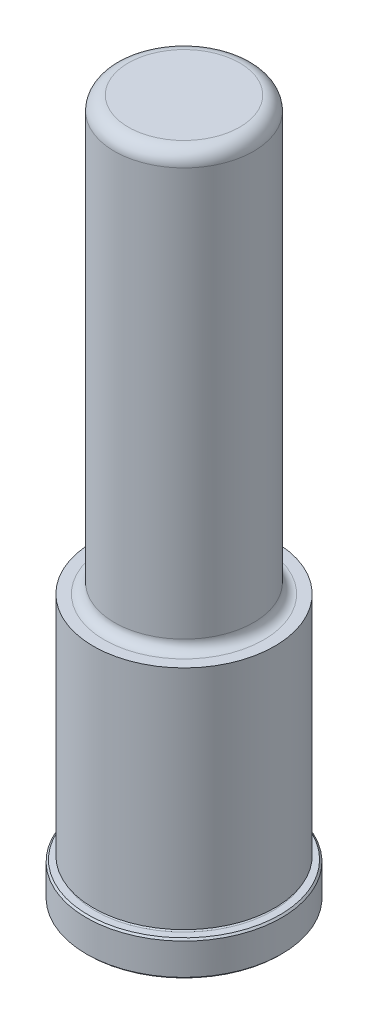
ISO-10303-21;
HEADER;
FILE_DESCRIPTION(('STEP AP214'),'2;1');
FILE_NAME('part.step','',(''),(''),'','','');
FILE_SCHEMA(('AUTOMOTIVE_DESIGN { 1 0 10303 214 1 1 1 1 }'));
ENDSEC;
DATA;
#1=APPLICATION_CONTEXT('core data for automotive mechanical design processes');
#2=APPLICATION_PROTOCOL_DEFINITION('international standard','automotive_design',2000,#1);
#3=PRODUCT_CONTEXT('',#1,'mechanical');
#4=PRODUCT('Part','Part','',(#3));
#5=PRODUCT_RELATED_PRODUCT_CATEGORY('part','',(#4));
#6=PRODUCT_DEFINITION_FORMATION('','',#4);
#7=PRODUCT_DEFINITION_CONTEXT('part definition',#1,'design');
#8=PRODUCT_DEFINITION('design','',#6,#7);
#9=PRODUCT_DEFINITION_SHAPE('','',#8);
#10=(LENGTH_UNIT() NAMED_UNIT(*) SI_UNIT(.MILLI.,.METRE.));
#11=(NAMED_UNIT(*) PLANE_ANGLE_UNIT() SI_UNIT($,.RADIAN.));
#12=(NAMED_UNIT(*) SI_UNIT($,.STERADIAN.) SOLID_ANGLE_UNIT());
#13=UNCERTAINTY_MEASURE_WITH_UNIT(LENGTH_MEASURE(1.E-05),#10,'distance_accuracy_value','');
#14=(GEOMETRIC_REPRESENTATION_CONTEXT(3) GLOBAL_UNCERTAINTY_ASSIGNED_CONTEXT((#13)) GLOBAL_UNIT_ASSIGNED_CONTEXT((#10,
#11,#12)) REPRESENTATION_CONTEXT('',''));
#15=CARTESIAN_POINT('',(0.,0.,0.));
#16=DIRECTION('',(0.,0.,1.));
#17=DIRECTION('',(1.,0.,0.));
#18=AXIS2_PLACEMENT_3D('',#15,#16,#17);
#19=CARTESIAN_POINT('',(0.,0.,0.));
#20=DIRECTION('',(0.,1.,0.));
#21=DIRECTION('',(0.,0.,1.));
#22=AXIS2_PLACEMENT_3D('',#19,#20,#21);
#23=PLANE('',#22);
#24=CARTESIAN_POINT('',(0.,0.,0.));
#25=DIRECTION('',(0.,1.,0.));
#26=DIRECTION('',(0.,0.,1.));
#27=AXIS2_PLACEMENT_3D('',#24,#25,#26);
#28=CIRCLE('',#27,21.844);
#29=CARTESIAN_POINT('',(0.,0.,21.844));
#30=VERTEX_POINT('',#29);
#31=EDGE_CURVE('E46',#30,#30,#28,.F.);
#32=ORIENTED_EDGE('',*,*,#31,.T.);
#33=EDGE_LOOP('',(#32));
#34=FACE_BOUND('',#33,.T.);
#35=ADVANCED_FACE('F31',(#34),#23,.F.);
#36=CARTESIAN_POINT('',(0.,0.,0.));
#37=DIRECTION('',(0.,1.,0.));
#38=DIRECTION('',(0.,0.,1.));
#39=AXIS2_PLACEMENT_3D('',#36,#37,#38);
#40=CYLINDRICAL_SURFACE('',#39,22.225);
#41=CARTESIAN_POINT('',(0.,0.380999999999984,0.));
#42=DIRECTION('',(0.,1.,0.));
#43=DIRECTION('',(0.,0.,1.));
#44=AXIS2_PLACEMENT_3D('',#41,#42,#43);
#45=CIRCLE('',#44,22.225);
#46=CARTESIAN_POINT('',(0.,0.380999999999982,22.225));
#47=VERTEX_POINT('',#46);
#48=EDGE_CURVE('E51',#47,#47,#45,.T.);
#49=ORIENTED_EDGE('',*,*,#48,.T.);
#50=EDGE_LOOP('',(#49));
#51=FACE_BOUND('',#50,.T.);
#52=CARTESIAN_POINT('',(0.,7.54379999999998,0.));
#53=DIRECTION('',(0.,-1.,0.));
#54=DIRECTION('',(0.,0.,-1.));
#55=AXIS2_PLACEMENT_3D('',#52,#53,#54);
#56=CIRCLE('',#55,22.225);
#57=CARTESIAN_POINT('',(0.,7.54379999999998,-22.225));
#58=VERTEX_POINT('',#57);
#59=EDGE_CURVE('E54',#58,#58,#56,.T.);
#60=ORIENTED_EDGE('',*,*,#59,.T.);
#61=EDGE_LOOP('',(#60));
#62=FACE_BOUND('',#61,.T.);
#63=ADVANCED_FACE('F110',(#51,#62),#40,.T.);
#64=CARTESIAN_POINT('',(0.,7.9248,-22.225));
#65=DIRECTION('',(0.,-1.,0.));
#66=DIRECTION('',(0.,0.,-1.));
#67=AXIS2_PLACEMENT_3D('',#64,#65,#66);
#68=PLANE('',#67);
#69=CARTESIAN_POINT('',(0.,7.9248,0.));
#70=DIRECTION('',(0.,-1.,0.));
#71=DIRECTION('',(0.,0.,-1.));
#72=AXIS2_PLACEMENT_3D('',#69,#70,#71);
#73=CIRCLE('',#72,21.844);
#74=CARTESIAN_POINT('',(0.,7.9248,-21.844));
#75=VERTEX_POINT('',#74);
#76=EDGE_CURVE('E42',#75,#75,#73,.F.);
#77=ORIENTED_EDGE('',*,*,#76,.T.);
#78=EDGE_LOOP('',(#77));
#79=FACE_BOUND('',#78,.T.);
#80=CARTESIAN_POINT('',(0.,7.9248,0.));
#81=DIRECTION('',(0.,1.,0.));
#82=DIRECTION('',(0.,0.,1.));
#83=AXIS2_PLACEMENT_3D('',#80,#81,#82);
#84=CIRCLE('',#83,20.2438);
#85=CARTESIAN_POINT('',(0.,7.92479999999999,20.2438));
#86=VERTEX_POINT('',#85);
#87=EDGE_CURVE('E57',#86,#86,#84,.T.);
#88=ORIENTED_EDGE('',*,*,#87,.F.);
#89=EDGE_LOOP('',(#88));
#90=FACE_BOUND('',#89,.T.);
#91=ADVANCED_FACE('F105',(#79,#90),#68,.F.);
#92=CARTESIAN_POINT('',(0.,8.3058,0.));
#93=DIRECTION('',(0.,1.,0.));
#94=DIRECTION('',(0.,0.,1.));
#95=AXIS2_PLACEMENT_3D('',#92,#93,#94);
#96=TOROIDAL_SURFACE('',#95,20.2438,0.380999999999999);
#97=CARTESIAN_POINT('',(0.,8.6868,0.));
#98=DIRECTION('',(0.,1.,0.));
#99=DIRECTION('',(0.,0.,1.));
#100=AXIS2_PLACEMENT_3D('',#97,#98,#99);
#101=CIRCLE('',#100,20.2438);
#102=CARTESIAN_POINT('',(0.,8.68679999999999,20.2438));
#103=VERTEX_POINT('',#102);
#104=EDGE_CURVE('E60',#103,#103,#101,.T.);
#105=ORIENTED_EDGE('',*,*,#104,.F.);
#106=EDGE_LOOP('',(#105));
#107=FACE_BOUND('',#106,.T.);
#108=ORIENTED_EDGE('',*,*,#87,.T.);
#109=EDGE_LOOP('',(#108));
#110=FACE_BOUND('',#109,.T.);
#111=ADVANCED_FACE('F99',(#107,#110),#96,.F.);
#112=CARTESIAN_POINT('',(0.,8.6868,-20.2438));
#113=DIRECTION('',(0.,1.,0.));
#114=DIRECTION('',(0.,0.,1.));
#115=AXIS2_PLACEMENT_3D('',#112,#113,#114);
#116=PLANE('',#115);
#117=CARTESIAN_POINT('',(0.,8.6868,0.));
#118=DIRECTION('',(0.,1.,0.));
#119=DIRECTION('',(0.,0.,1.));
#120=AXIS2_PLACEMENT_3D('',#117,#118,#119);
#121=CIRCLE('',#120,20.6502);
#122=CARTESIAN_POINT('',(0.,8.6868,20.6502));
#123=VERTEX_POINT('',#122);
#124=EDGE_CURVE('E63',#123,#123,#121,.T.);
#125=ORIENTED_EDGE('',*,*,#124,.F.);
#126=EDGE_LOOP('',(#125));
#127=FACE_BOUND('',#126,.T.);
#128=ORIENTED_EDGE('',*,*,#104,.T.);
#129=EDGE_LOOP('',(#128));
#130=FACE_BOUND('',#129,.T.);
#131=ADVANCED_FACE('F93',(#127,#130),#116,.F.);
#132=CARTESIAN_POINT('',(0.,0.,0.));
#133=DIRECTION('',(0.,1.,0.));
#134=DIRECTION('',(0.,0.,1.));
#135=AXIS2_PLACEMENT_3D('',#132,#133,#134);
#136=CYLINDRICAL_SURFACE('',#135,20.6502);
#137=CARTESIAN_POINT('',(0.,60.325,0.));
#138=DIRECTION('',(0.,1.,0.));
#139=DIRECTION('',(0.,0.,1.));
#140=AXIS2_PLACEMENT_3D('',#137,#138,#139);
#141=CIRCLE('',#140,20.6502);
#142=CARTESIAN_POINT('',(0.,60.325,20.6502));
#143=VERTEX_POINT('',#142);
#144=EDGE_CURVE('E66',#143,#143,#141,.T.);
#145=ORIENTED_EDGE('',*,*,#144,.F.);
#146=EDGE_LOOP('',(#145));
#147=FACE_BOUND('',#146,.T.);
#148=ORIENTED_EDGE('',*,*,#124,.T.);
#149=EDGE_LOOP('',(#148));
#150=FACE_BOUND('',#149,.T.);
#151=ADVANCED_FACE('F87',(#147,#150),#136,.T.);
#152=CARTESIAN_POINT('',(0.,60.325,-20.6502));
#153=DIRECTION('',(0.,-1.,0.));
#154=DIRECTION('',(0.,0.,-1.));
#155=AXIS2_PLACEMENT_3D('',#152,#153,#154);
#156=PLANE('',#155);
#157=CARTESIAN_POINT('',(0.,60.325,0.));
#158=DIRECTION('',(0.,1.,0.));
#159=DIRECTION('',(0.,0.,1.));
#160=AXIS2_PLACEMENT_3D('',#157,#158,#159);
#161=CIRCLE('',#160,18.1483);
#162=CARTESIAN_POINT('',(0.,60.325,18.1483));
#163=VERTEX_POINT('',#162);
#164=EDGE_CURVE('E69',#163,#163,#161,.T.);
#165=ORIENTED_EDGE('',*,*,#164,.F.);
#166=EDGE_LOOP('',(#165));
#167=FACE_BOUND('',#166,.T.);
#168=ORIENTED_EDGE('',*,*,#144,.T.);
#169=EDGE_LOOP('',(#168));
#170=FACE_BOUND('',#169,.T.);
#171=ADVANCED_FACE('F81',(#167,#170),#156,.F.);
#172=CARTESIAN_POINT('',(0.,62.611,0.));
#173=DIRECTION('',(0.,1.,0.));
#174=DIRECTION('',(0.,0.,1.));
#175=AXIS2_PLACEMENT_3D('',#172,#173,#174);
#176=TOROIDAL_SURFACE('',#175,18.1483,2.286);
#177=CARTESIAN_POINT('',(0.,62.611,0.));
#178=DIRECTION('',(0.,1.,0.));
#179=DIRECTION('',(0.,0.,1.));
#180=AXIS2_PLACEMENT_3D('',#177,#178,#179);
#181=CIRCLE('',#180,15.8623);
#182=CARTESIAN_POINT('',(0.,62.611,15.8623));
#183=VERTEX_POINT('',#182);
#184=EDGE_CURVE('E72',#183,#183,#181,.T.);
#185=ORIENTED_EDGE('',*,*,#184,.F.);
#186=EDGE_LOOP('',(#185));
#187=FACE_BOUND('',#186,.T.);
#188=ORIENTED_EDGE('',*,*,#164,.T.);
#189=EDGE_LOOP('',(#188));
#190=FACE_BOUND('',#189,.T.);
#191=ADVANCED_FACE('F78',(#187,#190),#176,.F.);
#192=CARTESIAN_POINT('',(0.,0.,0.));
#193=DIRECTION('',(0.,1.,0.));
#194=DIRECTION('',(0.,0.,1.));
#195=AXIS2_PLACEMENT_3D('',#192,#193,#194);
#196=CYLINDRICAL_SURFACE('',#195,15.8623);
#197=CARTESIAN_POINT('',(0.,155.575,0.));
#198=DIRECTION('',(0.,-1.,0.));
#199=DIRECTION('',(0.,0.,-1.));
#200=AXIS2_PLACEMENT_3D('',#197,#198,#199);
#201=CIRCLE('',#200,15.8623);
#202=CARTESIAN_POINT('',(0.,155.575,-15.8623));
#203=VERTEX_POINT('',#202);
#204=EDGE_CURVE('E10',#203,#203,#201,.T.);
#205=ORIENTED_EDGE('',*,*,#204,.T.);
#206=EDGE_LOOP('',(#205));
#207=FACE_BOUND('',#206,.T.);
#208=ORIENTED_EDGE('',*,*,#184,.T.);
#209=EDGE_LOOP('',(#208));
#210=FACE_BOUND('',#209,.T.);
#211=ADVANCED_FACE('F76',(#207,#210),#196,.T.);
#212=CARTESIAN_POINT('',(0.,158.75,-15.8623));
#213=DIRECTION('',(0.,-1.,0.));
#214=DIRECTION('',(0.,0.,-1.));
#215=AXIS2_PLACEMENT_3D('',#212,#213,#214);
#216=PLANE('',#215);
#217=CARTESIAN_POINT('',(0.,158.75,0.));
#218=DIRECTION('',(0.,-1.,0.));
#219=DIRECTION('',(0.,0.,-1.));
#220=AXIS2_PLACEMENT_3D('',#217,#218,#219);
#221=CIRCLE('',#220,12.6873);
#222=CARTESIAN_POINT('',(0.,158.75,-12.6873));
#223=VERTEX_POINT('',#222);
#224=EDGE_CURVE('E38',#223,#223,#221,.F.);
#225=ORIENTED_EDGE('',*,*,#224,.T.);
#226=EDGE_LOOP('',(#225));
#227=FACE_BOUND('',#226,.T.);
#228=ADVANCED_FACE('F127',(#227),#216,.F.);
#229=CARTESIAN_POINT('',(0.,0.380999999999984,0.));
#230=DIRECTION('',(0.,1.,0.));
#231=DIRECTION('',(0.,0.,1.));
#232=AXIS2_PLACEMENT_3D('',#229,#230,#231);
#233=CONICAL_SURFACE('',#232,22.225,0.785398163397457);
#234=ORIENTED_EDGE('',*,*,#31,.F.);
#235=EDGE_LOOP('',(#234));
#236=FACE_BOUND('',#235,.T.);
#237=ORIENTED_EDGE('',*,*,#48,.F.);
#238=EDGE_LOOP('',(#237));
#239=FACE_BOUND('',#238,.T.);
#240=ADVANCED_FACE('F124',(#236,#239),#233,.T.);
#241=CARTESIAN_POINT('',(0.,7.9248,0.));
#242=DIRECTION('',(0.,-1.,0.));
#243=DIRECTION('',(0.,0.,-1.));
#244=AXIS2_PLACEMENT_3D('',#241,#242,#243);
#245=CONICAL_SURFACE('',#244,21.844,0.785398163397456);
#246=ORIENTED_EDGE('',*,*,#59,.F.);
#247=EDGE_LOOP('',(#246));
#248=FACE_BOUND('',#247,.T.);
#249=ORIENTED_EDGE('',*,*,#76,.F.);
#250=EDGE_LOOP('',(#249));
#251=FACE_BOUND('',#250,.T.);
#252=ADVANCED_FACE('F126',(#248,#251),#245,.T.);
#253=CARTESIAN_POINT('',(0.,155.575,0.));
#254=DIRECTION('',(0.,-1.,0.));
#255=DIRECTION('',(0.,0.,-1.));
#256=AXIS2_PLACEMENT_3D('',#253,#254,#255);
#257=TOROIDAL_SURFACE('',#256,12.6873,3.175);
#258=ORIENTED_EDGE('',*,*,#204,.F.);
#259=EDGE_LOOP('',(#258));
#260=FACE_BOUND('',#259,.T.);
#261=ORIENTED_EDGE('',*,*,#224,.F.);
#262=EDGE_LOOP('',(#261));
#263=FACE_BOUND('',#262,.T.);
#264=ADVANCED_FACE('F33',(#260,#263),#257,.T.);
#265=CLOSED_SHELL('',(#35,#63,#91,#111,#131,#151,#171,#191,#211,#228,#240,#252,#264));
#266=MANIFOLD_SOLID_BREP('B2',#265);
#267=ADVANCED_BREP_SHAPE_REPRESENTATION('',(#18,#266),#14);
#268=SHAPE_DEFINITION_REPRESENTATION(#9,#267);
ENDSEC;
END-ISO-10303-21;
